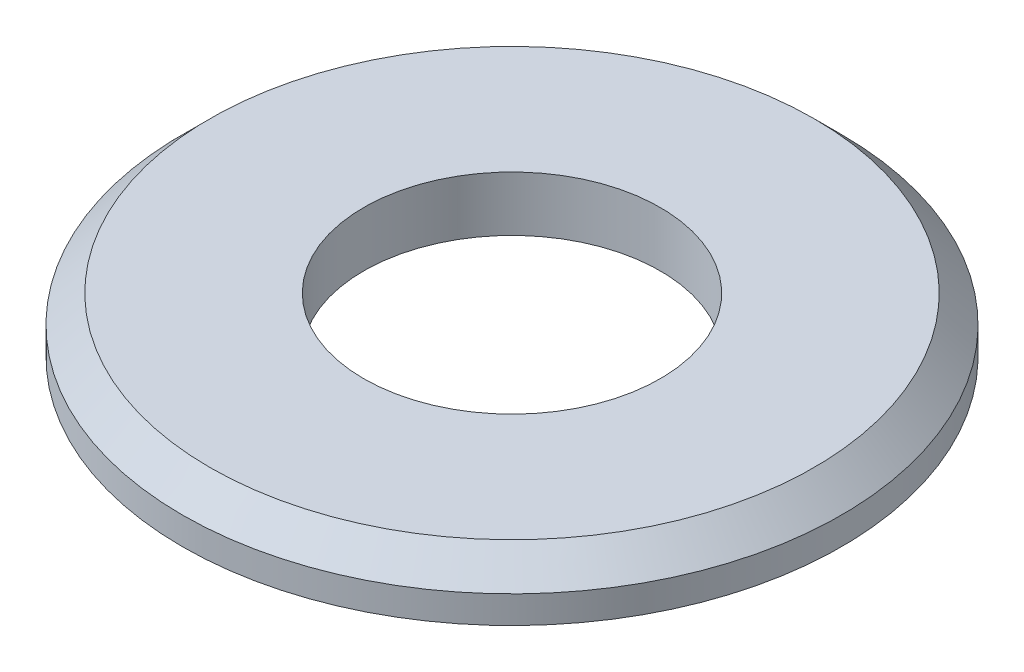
from build123d import *

# Parameters (mm, degrees)
SKETCH1_R      = 3
SKETCH1_R_2    = 1.35
EXTRUDE1_DEPTH = 0.5
CHAMFER1_SIZE  = 0.25


with BuildPart() as part:
    # Sketch1 → Extrude1 (new body)
    with BuildSketch(Plane(origin=(0, 0, 0), x_dir=(1, 0, 0), z_dir=(0, 1, 0))):
        with Locations(Location((0, 0, 0), (0, 0, 270))):
            Circle(SKETCH1_R)
        with Locations(Location((0, 0, 0), (0, 0, 270))):
            Circle(SKETCH1_R_2, mode=Mode.SUBTRACT)
    extrude(amount=EXTRUDE1_DEPTH)

    # Chamfer1
    chamfer1_edges = [part.edges().sort_by_distance(p)[0] for p in [
        (0, 0.5, -3),
    ]]
    chamfer(chamfer1_edges, length=CHAMFER1_SIZE)


solid = part.part
